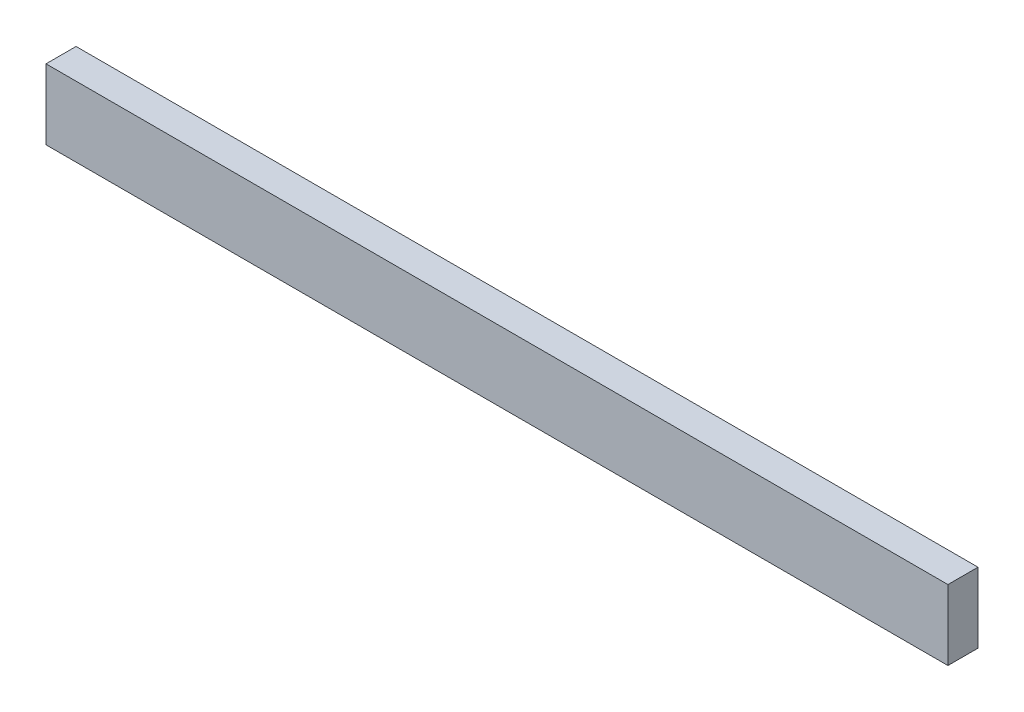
from build123d import *

# Parameters (mm, degrees)
SKETCH1_W           = 38.1
SKETCH1_H           = 88.9
BOSS_EXTRUDE1_DEPTH = 1143


with BuildPart() as part:
    # Sketch1 → Boss-Extrude1 (new body)
    with BuildSketch(Plane(origin=(0, 0, 0), x_dir=(0, 0, -1), z_dir=(1, 0, 0))):
        Rectangle(SKETCH1_W, SKETCH1_H)
    extrude(amount=BOSS_EXTRUDE1_DEPTH)


solid = part.part
